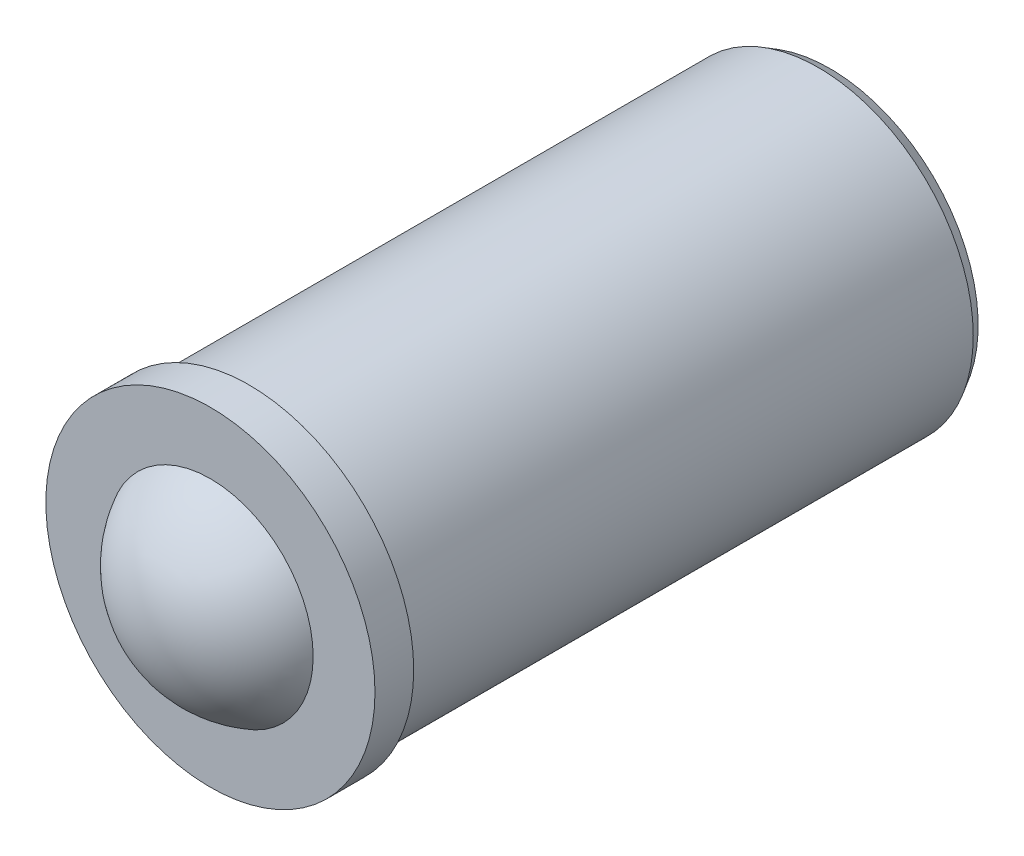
ISO-10303-21;
HEADER;
FILE_DESCRIPTION(('STEP AP214'),'2;1');
FILE_NAME('part.step','',(''),(''),'','','');
FILE_SCHEMA(('AUTOMOTIVE_DESIGN { 1 0 10303 214 1 1 1 1 }'));
ENDSEC;
DATA;
#1=APPLICATION_CONTEXT('core data for automotive mechanical design processes');
#2=APPLICATION_PROTOCOL_DEFINITION('international standard','automotive_design',2000,#1);
#3=PRODUCT_CONTEXT('',#1,'mechanical');
#4=PRODUCT('Part','Part','',(#3));
#5=PRODUCT_RELATED_PRODUCT_CATEGORY('part','',(#4));
#6=PRODUCT_DEFINITION_FORMATION('','',#4);
#7=PRODUCT_DEFINITION_CONTEXT('part definition',#1,'design');
#8=PRODUCT_DEFINITION('design','',#6,#7);
#9=PRODUCT_DEFINITION_SHAPE('','',#8);
#10=(LENGTH_UNIT() NAMED_UNIT(*) SI_UNIT(.MILLI.,.METRE.));
#11=(NAMED_UNIT(*) PLANE_ANGLE_UNIT() SI_UNIT($,.RADIAN.));
#12=(NAMED_UNIT(*) SI_UNIT($,.STERADIAN.) SOLID_ANGLE_UNIT());
#13=UNCERTAINTY_MEASURE_WITH_UNIT(LENGTH_MEASURE(1.E-05),#10,'distance_accuracy_value','');
#14=(GEOMETRIC_REPRESENTATION_CONTEXT(3) GLOBAL_UNCERTAINTY_ASSIGNED_CONTEXT((#13)) GLOBAL_UNIT_ASSIGNED_CONTEXT((#10,
#11,#12)) REPRESENTATION_CONTEXT('',''));
#15=CARTESIAN_POINT('',(0.,0.,0.));
#16=DIRECTION('',(0.,0.,1.));
#17=DIRECTION('',(1.,0.,0.));
#18=AXIS2_PLACEMENT_3D('',#15,#16,#17);
#19=CARTESIAN_POINT('',(0.,4.,-15.));
#20=DIRECTION('',(0.,0.,-1.));
#21=DIRECTION('',(-1.,0.,0.));
#22=AXIS2_PLACEMENT_3D('',#19,#20,#21);
#23=PLANE('',#22);
#24=CARTESIAN_POINT('',(0.,0.,-15.));
#25=DIRECTION('',(0.,0.,-1.));
#26=DIRECTION('',(-1.,0.,0.));
#27=AXIS2_PLACEMENT_3D('',#24,#25,#26);
#28=CIRCLE('',#27,3.82679491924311);
#29=CARTESIAN_POINT('',(-3.82679491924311,0.,-15.));
#30=VERTEX_POINT('',#29);
#31=EDGE_CURVE('E8',#30,#30,#28,.T.);
#32=ORIENTED_EDGE('',*,*,#31,.T.);
#33=EDGE_LOOP('',(#32));
#34=FACE_BOUND('',#33,.T.);
#35=ADVANCED_FACE('F12',(#34),#23,.T.);
#36=CARTESIAN_POINT('',(0.,3.2,1.));
#37=DIRECTION('',(0.,0.,1.));
#38=DIRECTION('',(1.,0.,0.));
#39=AXIS2_PLACEMENT_3D('',#36,#37,#38);
#40=PLANE('',#39);
#41=CARTESIAN_POINT('',(0.,0.,1.));
#42=DIRECTION('',(0.,0.,1.));
#43=DIRECTION('',(1.,0.,0.));
#44=AXIS2_PLACEMENT_3D('',#41,#42,#43);
#45=CIRCLE('',#44,4.25);
#46=CARTESIAN_POINT('',(4.25,0.,1.));
#47=VERTEX_POINT('',#46);
#48=EDGE_CURVE('E27',#47,#47,#45,.T.);
#49=ORIENTED_EDGE('',*,*,#48,.T.);
#50=EDGE_LOOP('',(#49));
#51=FACE_BOUND('',#50,.T.);
#52=CARTESIAN_POINT('',(0.,0.,1.));
#53=DIRECTION('',(0.,0.,1.));
#54=DIRECTION('',(1.,0.,0.));
#55=AXIS2_PLACEMENT_3D('',#52,#53,#54);
#56=CIRCLE('',#55,2.65329983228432);
#57=CARTESIAN_POINT('',(2.65329983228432,0.,1.));
#58=VERTEX_POINT('',#57);
#59=EDGE_CURVE('E23',#58,#58,#56,.F.);
#60=ORIENTED_EDGE('',*,*,#59,.T.);
#61=EDGE_LOOP('',(#60));
#62=FACE_BOUND('',#61,.T.);
#63=ADVANCED_FACE('F56',(#51,#62),#40,.T.);
#64=CARTESIAN_POINT('',(0.,0.,1.));
#65=DIRECTION('',(0.,0.,1.));
#66=DIRECTION('',(1.,0.,0.));
#67=AXIS2_PLACEMENT_3D('',#64,#65,#66);
#68=CYLINDRICAL_SURFACE('',#67,4.25);
#69=CARTESIAN_POINT('',(0.,0.,0.));
#70=DIRECTION('',(0.,0.,1.));
#71=DIRECTION('',(1.,0.,0.));
#72=AXIS2_PLACEMENT_3D('',#69,#70,#71);
#73=CIRCLE('',#72,4.25);
#74=CARTESIAN_POINT('',(4.25,0.,0.));
#75=VERTEX_POINT('',#74);
#76=EDGE_CURVE('E32',#75,#75,#73,.T.);
#77=ORIENTED_EDGE('',*,*,#76,.T.);
#78=EDGE_LOOP('',(#77));
#79=FACE_BOUND('',#78,.T.);
#80=ORIENTED_EDGE('',*,*,#48,.F.);
#81=EDGE_LOOP('',(#80));
#82=FACE_BOUND('',#81,.T.);
#83=ADVANCED_FACE('F53',(#79,#82),#68,.T.);
#84=CARTESIAN_POINT('',(0.,4.25,0.));
#85=DIRECTION('',(0.,0.,-1.));
#86=DIRECTION('',(-1.,0.,0.));
#87=AXIS2_PLACEMENT_3D('',#84,#85,#86);
#88=PLANE('',#87);
#89=CARTESIAN_POINT('',(0.,0.,0.));
#90=DIRECTION('',(0.,0.,1.));
#91=DIRECTION('',(1.,0.,0.));
#92=AXIS2_PLACEMENT_3D('',#89,#90,#91);
#93=CIRCLE('',#92,4.);
#94=CARTESIAN_POINT('',(4.,0.,0.));
#95=VERTEX_POINT('',#94);
#96=EDGE_CURVE('E35',#95,#95,#93,.T.);
#97=ORIENTED_EDGE('',*,*,#96,.T.);
#98=EDGE_LOOP('',(#97));
#99=FACE_BOUND('',#98,.T.);
#100=ORIENTED_EDGE('',*,*,#76,.F.);
#101=EDGE_LOOP('',(#100));
#102=FACE_BOUND('',#101,.T.);
#103=ADVANCED_FACE('F39',(#99,#102),#88,.T.);
#104=CARTESIAN_POINT('',(0.,0.,1.));
#105=DIRECTION('',(0.,0.,1.));
#106=DIRECTION('',(1.,0.,0.));
#107=AXIS2_PLACEMENT_3D('',#104,#105,#106);
#108=CYLINDRICAL_SURFACE('',#107,4.);
#109=CARTESIAN_POINT('',(0.,0.,-14.7));
#110=DIRECTION('',(0.,0.,-1.));
#111=DIRECTION('',(-1.,0.,0.));
#112=AXIS2_PLACEMENT_3D('',#109,#110,#111);
#113=CIRCLE('',#112,4.);
#114=CARTESIAN_POINT('',(-4.,0.,-14.7));
#115=VERTEX_POINT('',#114);
#116=EDGE_CURVE('E19',#115,#115,#113,.F.);
#117=ORIENTED_EDGE('',*,*,#116,.T.);
#118=EDGE_LOOP('',(#117));
#119=FACE_BOUND('',#118,.T.);
#120=ORIENTED_EDGE('',*,*,#96,.F.);
#121=EDGE_LOOP('',(#120));
#122=FACE_BOUND('',#121,.T.);
#123=ADVANCED_FACE('F42',(#119,#122),#108,.T.);
#124=CARTESIAN_POINT('',(0.,0.,-0.4));
#125=DIRECTION('',(0.,0.,1.));
#126=DIRECTION('',(0.,-1.,0.));
#127=AXIS2_PLACEMENT_3D('',#124,#125,#126);
#128=SPHERICAL_SURFACE('',#127,3.);
#129=ORIENTED_EDGE('',*,*,#59,.F.);
#130=EDGE_LOOP('',(#129));
#131=FACE_BOUND('',#130,.T.);
#132=ADVANCED_FACE('F44',(#131),#128,.T.);
#133=CARTESIAN_POINT('',(0.,0.,-14.7));
#134=DIRECTION('',(0.,0.,1.));
#135=DIRECTION('',(1.,0.,0.));
#136=AXIS2_PLACEMENT_3D('',#133,#134,#135);
#137=CONICAL_SURFACE('',#136,4.,0.523598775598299);
#138=ORIENTED_EDGE('',*,*,#31,.F.);
#139=EDGE_LOOP('',(#138));
#140=FACE_BOUND('',#139,.T.);
#141=ORIENTED_EDGE('',*,*,#116,.F.);
#142=EDGE_LOOP('',(#141));
#143=FACE_BOUND('',#142,.T.);
#144=ADVANCED_FACE('F14',(#140,#143),#137,.T.);
#145=CLOSED_SHELL('',(#35,#63,#83,#103,#123,#132,#144));
#146=MANIFOLD_SOLID_BREP('B1',#145);
#147=ADVANCED_BREP_SHAPE_REPRESENTATION('',(#18,#146),#14);
#148=SHAPE_DEFINITION_REPRESENTATION(#9,#147);
ENDSEC;
END-ISO-10303-21;
